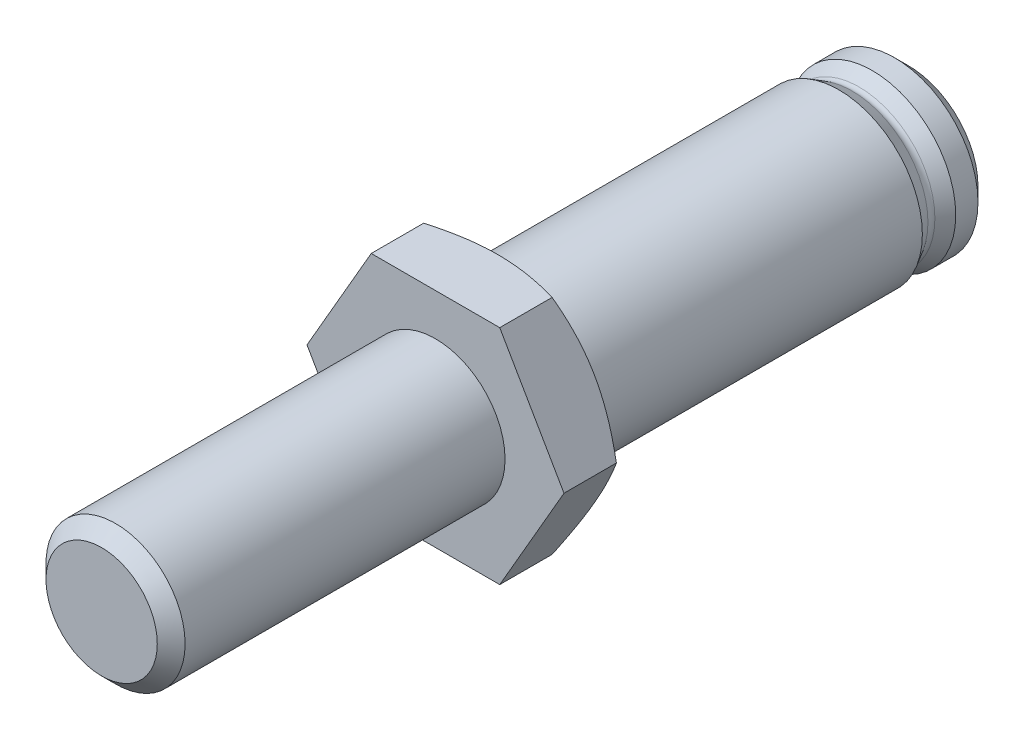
ISO-10303-21;
HEADER;
FILE_DESCRIPTION(('STEP AP214'),'2;1');
FILE_NAME('part.step','',(''),(''),'','','');
FILE_SCHEMA(('AUTOMOTIVE_DESIGN { 1 0 10303 214 1 1 1 1 }'));
ENDSEC;
DATA;
#1=APPLICATION_CONTEXT('core data for automotive mechanical design processes');
#2=APPLICATION_PROTOCOL_DEFINITION('international standard','automotive_design',2000,#1);
#3=PRODUCT_CONTEXT('',#1,'mechanical');
#4=PRODUCT('Part','Part','',(#3));
#5=PRODUCT_RELATED_PRODUCT_CATEGORY('part','',(#4));
#6=PRODUCT_DEFINITION_FORMATION('','',#4);
#7=PRODUCT_DEFINITION_CONTEXT('part definition',#1,'design');
#8=PRODUCT_DEFINITION('design','',#6,#7);
#9=PRODUCT_DEFINITION_SHAPE('','',#8);
#10=(LENGTH_UNIT() NAMED_UNIT(*) SI_UNIT(.MILLI.,.METRE.));
#11=(NAMED_UNIT(*) PLANE_ANGLE_UNIT() SI_UNIT($,.RADIAN.));
#12=(NAMED_UNIT(*) SI_UNIT($,.STERADIAN.) SOLID_ANGLE_UNIT());
#13=UNCERTAINTY_MEASURE_WITH_UNIT(LENGTH_MEASURE(1.E-05),#10,'distance_accuracy_value','');
#14=(GEOMETRIC_REPRESENTATION_CONTEXT(3) GLOBAL_UNCERTAINTY_ASSIGNED_CONTEXT((#13)) GLOBAL_UNIT_ASSIGNED_CONTEXT((#10,
#11,#12)) REPRESENTATION_CONTEXT('',''));
#15=CARTESIAN_POINT('',(0.,0.,0.));
#16=DIRECTION('',(0.,0.,1.));
#17=DIRECTION('',(1.,0.,0.));
#18=AXIS2_PLACEMENT_3D('',#15,#16,#17);
#19=CARTESIAN_POINT('',(6.9282032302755,4.,0.));
#20=DIRECTION('',(0.,0.,1.));
#21=DIRECTION('',(1.,0.,0.));
#22=AXIS2_PLACEMENT_3D('',#19,#20,#21);
#23=PLANE('',#22);
#24=DIRECTION('',(0.499999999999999,0.866025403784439,0.));
#25=VECTOR('',#24,1.);
#26=CARTESIAN_POINT('',(2.3094010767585,-4.00000000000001,0.));
#27=LINE('',#26,#25);
#28=CARTESIAN_POINT('',(2.3094010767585,-4.00000000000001,0.));
#29=VERTEX_POINT('',#28);
#30=CARTESIAN_POINT('',(4.61880215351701,0.,0.));
#31=VERTEX_POINT('',#30);
#32=EDGE_CURVE('E92',#29,#31,#27,.T.);
#33=ORIENTED_EDGE('',*,*,#32,.T.);
#34=DIRECTION('',(-0.5,0.866025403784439,0.));
#35=VECTOR('',#34,1.);
#36=CARTESIAN_POINT('',(4.61880215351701,0.,0.));
#37=LINE('',#36,#35);
#38=CARTESIAN_POINT('',(2.30940107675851,4.,0.));
#39=VERTEX_POINT('',#38);
#40=EDGE_CURVE('E97',#31,#39,#37,.T.);
#41=ORIENTED_EDGE('',*,*,#40,.T.);
#42=DIRECTION('',(-1.,0.,0.));
#43=VECTOR('',#42,1.);
#44=CARTESIAN_POINT('',(2.30940107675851,4.,0.));
#45=LINE('',#44,#43);
#46=CARTESIAN_POINT('',(-2.3094010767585,4.,0.));
#47=VERTEX_POINT('',#46);
#48=EDGE_CURVE('E244',#39,#47,#45,.T.);
#49=ORIENTED_EDGE('',*,*,#48,.T.);
#50=DIRECTION('',(-0.499999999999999,-0.866025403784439,0.));
#51=VECTOR('',#50,1.);
#52=CARTESIAN_POINT('',(-2.3094010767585,4.,0.));
#53=LINE('',#52,#51);
#54=CARTESIAN_POINT('',(-4.618802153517,0.,0.));
#55=VERTEX_POINT('',#54);
#56=EDGE_CURVE('E246',#47,#55,#53,.T.);
#57=ORIENTED_EDGE('',*,*,#56,.T.);
#58=DIRECTION('',(0.500000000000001,-0.866025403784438,0.));
#59=VECTOR('',#58,1.);
#60=CARTESIAN_POINT('',(-4.618802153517,0.,0.));
#61=LINE('',#60,#59);
#62=CARTESIAN_POINT('',(-2.30940107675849,-4.00000000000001,0.));
#63=VERTEX_POINT('',#62);
#64=EDGE_CURVE('E105',#55,#63,#61,.T.);
#65=ORIENTED_EDGE('',*,*,#64,.T.);
#66=DIRECTION('',(1.,0.,0.));
#67=VECTOR('',#66,1.);
#68=CARTESIAN_POINT('',(-2.30940107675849,-4.00000000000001,0.));
#69=LINE('',#68,#67);
#70=EDGE_CURVE('E100',#63,#29,#69,.T.);
#71=ORIENTED_EDGE('',*,*,#70,.T.);
#72=EDGE_LOOP('',(#33,#41,#49,#57,#65,#71));
#73=FACE_BOUND('',#72,.T.);
#74=CARTESIAN_POINT('',(0.,0.,0.));
#75=DIRECTION('',(0.,0.,1.));
#76=DIRECTION('',(1.,0.,0.));
#77=AXIS2_PLACEMENT_3D('',#74,#75,#76);
#78=CIRCLE('',#77,2.5);
#79=CARTESIAN_POINT('',(2.5,0.,0.));
#80=VERTEX_POINT('',#79);
#81=EDGE_CURVE('E218',#80,#80,#78,.T.);
#82=ORIENTED_EDGE('',*,*,#81,.F.);
#83=EDGE_LOOP('',(#82));
#84=FACE_BOUND('',#83,.T.);
#85=ADVANCED_FACE('F26',(#73,#84),#23,.T.);
#86=CARTESIAN_POINT('',(2.3094010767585,-4.00000000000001,-17.));
#87=DIRECTION('',(0.866025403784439,-0.499999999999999,0.));
#88=DIRECTION('',(0.499999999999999,0.866025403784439,0.));
#89=AXIS2_PLACEMENT_3D('',#86,#87,#88);
#90=PLANE('',#89);
#91=DIRECTION('',(0.,0.,1.));
#92=VECTOR('',#91,1.);
#93=CARTESIAN_POINT('',(2.3094010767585,-4.00000000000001,-17.));
#94=LINE('',#93,#92);
#95=CARTESIAN_POINT('',(2.3094010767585,-4.00000000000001,-1.88291128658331));
#96=VERTEX_POINT('',#95);
#97=EDGE_CURVE('E50',#96,#29,#94,.T.);
#98=ORIENTED_EDGE('',*,*,#97,.F.);
#99=CARTESIAN_POINT('',(2.30928560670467,-4.00020000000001,-1.8828446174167));
#100=CARTESIAN_POINT('',(2.4107717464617,-3.82442084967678,-1.94145900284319));
#101=CARTESIAN_POINT('',(2.51313390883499,-3.64712438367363,-1.99476655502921));
#102=CARTESIAN_POINT('',(2.71963072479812,-3.2894614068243,-2.08781520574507));
#103=CARTESIAN_POINT('',(2.82376904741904,-3.10908854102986,-2.12752338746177));
#104=CARTESIAN_POINT('',(3.03075510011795,-2.75057818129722,-2.18933466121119));
#105=CARTESIAN_POINT('',(3.13357098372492,-2.57249584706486,-2.21184914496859));
#106=CARTESIAN_POINT('',(3.33968651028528,-2.2154932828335,-2.23872625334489));
#107=CARTESIAN_POINT('',(3.44298540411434,-2.0365743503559,-2.24311113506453));
#108=CARTESIAN_POINT('',(3.63600352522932,-1.70225715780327,-2.23398680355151));
#109=CARTESIAN_POINT('',(3.72575165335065,-1.54680884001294,-2.22271792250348));
#110=CARTESIAN_POINT('',(3.90466320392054,-1.23692494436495,-2.18700288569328));
#111=CARTESIAN_POINT('',(3.99382600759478,-1.08249043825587,-2.16254453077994));
#112=CARTESIAN_POINT('',(4.17310641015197,-0.771967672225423,-2.10140081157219));
#113=CARTESIAN_POINT('',(4.26320131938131,-0.615918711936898,-2.06445627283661));
#114=CARTESIAN_POINT('',(4.4420474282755,-0.306148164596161,-1.98060680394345));
#115=CARTESIAN_POINT('',(4.53080091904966,-0.152422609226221,-1.93372157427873));
#116=CARTESIAN_POINT('',(4.61891762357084,0.000199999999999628,-1.88284461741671));
#117=B_SPLINE_CURVE_WITH_KNOTS('',3,(#99,#100,#101,#102,#103,#104,#105,#106,#107,#108,#109,#110,
#111,#112,#113,#114,#115,#116),.UNSPECIFIED.,.F.,.F.,(4,2,2,2,2,2,2,2,4),(0.,0.634047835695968,
1.26961969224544,1.88946157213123,2.50854226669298,3.04757825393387,3.58711366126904,
4.13861653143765,4.68903648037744),.UNSPECIFIED.);
#118=CARTESIAN_POINT('',(4.61880215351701,0.,-1.88291128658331));
#119=VERTEX_POINT('',#118);
#120=EDGE_CURVE('E83',#96,#119,#117,.T.);
#121=ORIENTED_EDGE('',*,*,#120,.T.);
#122=DIRECTION('',(0.,0.,1.));
#123=VECTOR('',#122,1.);
#124=CARTESIAN_POINT('',(4.61880215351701,0.,-17.));
#125=LINE('',#124,#123);
#126=EDGE_CURVE('E90',#119,#31,#125,.T.);
#127=ORIENTED_EDGE('',*,*,#126,.T.);
#128=ORIENTED_EDGE('',*,*,#32,.F.);
#129=EDGE_LOOP('',(#98,#121,#127,#128));
#130=FACE_BOUND('',#129,.T.);
#131=ADVANCED_FACE('F28',(#130),#90,.T.);
#132=CARTESIAN_POINT('',(-2.30940107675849,-4.00000000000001,-17.));
#133=DIRECTION('',(0.,-1.,0.));
#134=DIRECTION('',(0.,0.,-1.));
#135=AXIS2_PLACEMENT_3D('',#132,#133,#134);
#136=PLANE('',#135);
#137=DIRECTION('',(0.,0.,1.));
#138=VECTOR('',#137,1.);
#139=CARTESIAN_POINT('',(-2.30940107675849,-4.00000000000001,-17.));
#140=LINE('',#139,#138);
#141=CARTESIAN_POINT('',(-2.30940107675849,-4.00000000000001,-1.88291128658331));
#142=VERTEX_POINT('',#141);
#143=EDGE_CURVE('E235',#142,#63,#140,.T.);
#144=ORIENTED_EDGE('',*,*,#143,.F.);
#145=CARTESIAN_POINT('',(-6.10542974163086,-4.00000000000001,-0.335463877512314));
#146=CARTESIAN_POINT('',(-5.93151044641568,-4.00000000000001,-0.419431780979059));
#147=CARTESIAN_POINT('',(-5.7571811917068,-4.00000000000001,-0.502565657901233));
#148=CARTESIAN_POINT('',(-5.40748433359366,-4.00000000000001,-0.666694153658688));
#149=CARTESIAN_POINT('',(-5.23211656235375,-4.00000000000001,-0.747688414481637));
#150=CARTESIAN_POINT('',(-4.87917281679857,-4.00000000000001,-0.907495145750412));
#151=CARTESIAN_POINT('',(-4.70158994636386,-4.00000000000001,-0.986292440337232));
#152=CARTESIAN_POINT('',(-4.34497688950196,-4.00000000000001,-1.14052833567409));
#153=CARTESIAN_POINT('',(-4.16594677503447,-4.00000000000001,-1.21596710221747));
#154=CARTESIAN_POINT('',(-3.8007872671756,-4.00000000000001,-1.36478316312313));
#155=CARTESIAN_POINT('',(-3.61460526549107,-4.00000000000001,-1.43803209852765));
#156=CARTESIAN_POINT('',(-3.24002721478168,-4.00000000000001,-1.57874525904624));
#157=CARTESIAN_POINT('',(-3.05163091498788,-4.00000000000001,-1.6462088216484));
#158=CARTESIAN_POINT('',(-2.67271004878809,-4.00000000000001,-1.77350816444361));
#159=CARTESIAN_POINT('',(-2.48219102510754,-4.00000000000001,-1.83336027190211));
#160=CARTESIAN_POINT('',(-2.09842290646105,-4.00000000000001,-1.94345204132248));
#161=CARTESIAN_POINT('',(-1.90517472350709,-4.00000000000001,-1.99369483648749));
#162=CARTESIAN_POINT('',(-1.5168810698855,-4.00000000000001,-2.08183473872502));
#163=CARTESIAN_POINT('',(-1.32185005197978,-4.00000000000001,-2.11979431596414));
#164=CARTESIAN_POINT('',(-0.929469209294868,-4.00000000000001,-2.18115225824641));
#165=CARTESIAN_POINT('',(-0.732119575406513,-4.00000000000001,-2.20455181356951));
#166=CARTESIAN_POINT('',(-0.33862225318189,-4.00000000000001,-2.23461550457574));
#167=CARTESIAN_POINT('',(-0.142490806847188,-4.00000000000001,-2.24148702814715));
#168=CARTESIAN_POINT('',(0.249655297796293,-4.00000000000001,-2.23845234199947));
#169=CARTESIAN_POINT('',(0.445669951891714,-4.00000000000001,-2.22854555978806));
#170=CARTESIAN_POINT('',(0.781417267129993,-4.00000000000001,-2.19789206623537));
#171=CARTESIAN_POINT('',(0.921517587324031,-4.00000000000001,-2.18096449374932));
#172=CARTESIAN_POINT('',(1.2006212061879,-4.00000000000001,-2.13964654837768));
#173=CARTESIAN_POINT('',(1.33962434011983,-4.00000000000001,-2.11525507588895));
#174=CARTESIAN_POINT('',(1.75484240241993,-4.00000000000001,-2.03217461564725));
#175=CARTESIAN_POINT('',(2.02909693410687,-4.00000000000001,-1.96359699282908));
#176=CARTESIAN_POINT('',(2.43908664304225,-4.00000000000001,-1.84558669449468));
#177=CARTESIAN_POINT('',(2.57696821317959,-4.00000000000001,-1.8031940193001));
#178=CARTESIAN_POINT('',(2.85139071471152,-4.00000000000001,-1.71423334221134));
#179=CARTESIAN_POINT('',(2.98793163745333,-4.00000000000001,-1.66766531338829));
#180=CARTESIAN_POINT('',(3.25972084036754,-4.00000000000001,-1.57108214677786));
#181=CARTESIAN_POINT('',(3.39496957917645,-4.00000000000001,-1.52106828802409));
#182=CARTESIAN_POINT('',(3.6643617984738,-4.00000000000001,-1.41815906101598));
#183=CARTESIAN_POINT('',(3.7985052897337,-4.00000000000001,-1.36526372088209));
#184=CARTESIAN_POINT('',(4.10570582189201,-4.00000000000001,-1.24092840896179));
#185=CARTESIAN_POINT('',(4.27842892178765,-4.00000000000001,-1.16866505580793));
#186=CARTESIAN_POINT('',(4.62249700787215,-4.00000000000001,-1.02092061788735));
#187=CARTESIAN_POINT('',(4.79384192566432,-4.00000000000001,-0.945439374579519));
#188=CARTESIAN_POINT('',(5.13539733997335,-4.00000000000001,-0.791882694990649));
#189=CARTESIAN_POINT('',(5.30560764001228,-4.00000000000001,-0.713806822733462));
#190=CARTESIAN_POINT('',(5.64505145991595,-4.00000000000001,-0.555556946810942));
#191=CARTESIAN_POINT('',(5.81428496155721,-4.00000000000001,-0.475382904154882));
#192=CARTESIAN_POINT('',(6.32105005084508,-4.00000000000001,-0.232163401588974));
#193=CARTESIAN_POINT('',(6.65735099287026,-4.00000000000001,-0.0665549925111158));
#194=CARTESIAN_POINT('',(7.32760205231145,-4.00000000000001,0.269350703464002));
#195=CARTESIAN_POINT('',(7.66155209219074,-4.00000000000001,0.439648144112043));
#196=CARTESIAN_POINT('',(8.30140615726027,-4.00000000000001,0.770025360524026));
#197=CARTESIAN_POINT('',(8.6074422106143,-4.00000000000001,0.929849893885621));
#198=CARTESIAN_POINT('',(9.21838650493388,-4.00000000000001,1.25165862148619));
#199=CARTESIAN_POINT('',(9.52329471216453,-4.00000000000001,1.4136428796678));
#200=CARTESIAN_POINT('',(10.1315547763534,-4.00000000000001,1.73891005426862));
#201=CARTESIAN_POINT('',(10.4349085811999,-4.00000000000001,1.90218933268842));
#202=CARTESIAN_POINT('',(11.0408897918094,-4.00000000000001,2.23005574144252));
#203=CARTESIAN_POINT('',(11.3435172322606,-4.00000000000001,2.39464280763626));
#204=CARTESIAN_POINT('',(11.6458746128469,-4.00000000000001,2.55972101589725));
#205=B_SPLINE_CURVE_WITH_KNOTS('',3,(#145,#146,#147,#148,#149,#150,#151,#152,#153,#154,#155,
#156,#157,#158,#159,#160,#161,#162,#163,#164,#165,#166,#167,#168,#169,#170,#171,#172,#173,#174,
#175,#176,#177,#178,#179,#180,#181,#182,#183,#184,#185,#186,#187,#188,#189,#190,#191,#192,#193,
#194,#195,#196,#197,#198,#199,#200,#201,#202,#203,#204),.UNSPECIFIED.,.F.,.F.,(4,2,2,2,2,2,2,2,
2,2,2,2,2,2,2,2,2,2,2,2,2,2,2,2,2,2,2,2,2,4),(0.,0.579392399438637,1.15888113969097,
1.74169313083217,2.32447631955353,2.92462062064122,3.52483355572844,4.12373644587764,
4.72244372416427,5.31805639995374,5.91362037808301,6.50167152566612,7.08974273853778,
7.51289330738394,7.93610624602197,8.78303968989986,9.21576030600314,9.64848371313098,
10.0810473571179,10.5136067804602,11.0752552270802,11.6369313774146,12.1987023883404,
12.7604838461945,13.8850197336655,15.0095925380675,16.0453502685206,17.0811387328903,
18.1146500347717,19.1481109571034),.UNSPECIFIED.);
#206=EDGE_CURVE('E93',#142,#96,#205,.T.);
#207=ORIENTED_EDGE('',*,*,#206,.T.);
#208=ORIENTED_EDGE('',*,*,#97,.T.);
#209=ORIENTED_EDGE('',*,*,#70,.F.);
#210=EDGE_LOOP('',(#144,#207,#208,#209));
#211=FACE_BOUND('',#210,.T.);
#212=ADVANCED_FACE('F156',(#211),#136,.T.);
#213=CARTESIAN_POINT('',(-4.618802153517,0.,-17.));
#214=DIRECTION('',(-0.866025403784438,-0.500000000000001,0.));
#215=DIRECTION('',(0.500000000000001,-0.866025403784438,0.));
#216=AXIS2_PLACEMENT_3D('',#213,#214,#215);
#217=PLANE('',#216);
#218=DIRECTION('',(0.,0.,1.));
#219=VECTOR('',#218,1.);
#220=CARTESIAN_POINT('',(-4.618802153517,0.,-17.));
#221=LINE('',#220,#219);
#222=CARTESIAN_POINT('',(-4.618802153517,0.,-1.88291128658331));
#223=VERTEX_POINT('',#222);
#224=EDGE_CURVE('E237',#223,#55,#221,.T.);
#225=ORIENTED_EDGE('',*,*,#224,.F.);
#226=CARTESIAN_POINT('',(-4.61891762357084,0.000199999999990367,-1.88284461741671));
#227=CARTESIAN_POINT('',(-4.5174314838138,-0.175579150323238,-1.94145900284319));
#228=CARTESIAN_POINT('',(-4.41506932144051,-0.35287561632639,-1.99476655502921));
#229=CARTESIAN_POINT('',(-4.20857250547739,-0.710538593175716,-2.08781520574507));
#230=CARTESIAN_POINT('',(-4.10443418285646,-0.89091145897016,-2.12752338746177));
#231=CARTESIAN_POINT('',(-3.89744813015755,-1.2494218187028,-2.1893346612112));
#232=CARTESIAN_POINT('',(-3.79463224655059,-1.42750415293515,-2.21184914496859));
#233=CARTESIAN_POINT('',(-3.58851671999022,-1.78450671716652,-2.2387262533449));
#234=CARTESIAN_POINT('',(-3.48521782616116,-1.96342564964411,-2.24311113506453));
#235=CARTESIAN_POINT('',(-3.29219970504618,-2.29774284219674,-2.23398680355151));
#236=CARTESIAN_POINT('',(-3.20245157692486,-2.45319115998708,-2.22271792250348));
#237=CARTESIAN_POINT('',(-3.02354002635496,-2.76307505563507,-2.18700288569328));
#238=CARTESIAN_POINT('',(-2.93437722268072,-2.91750956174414,-2.16254453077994));
#239=CARTESIAN_POINT('',(-2.75509682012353,-3.22803232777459,-2.10140081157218));
#240=CARTESIAN_POINT('',(-2.66500191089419,-3.38408128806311,-2.06445627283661));
#241=CARTESIAN_POINT('',(-2.486155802,-3.69385183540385,-1.98060680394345));
#242=CARTESIAN_POINT('',(-2.39740231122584,-3.84757739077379,-1.93372157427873));
#243=CARTESIAN_POINT('',(-2.30928560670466,-4.00020000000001,-1.88284461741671));
#244=B_SPLINE_CURVE_WITH_KNOTS('',3,(#226,#227,#228,#229,#230,#231,#232,#233,#234,#235,#236,
#237,#238,#239,#240,#241,#242,#243),.UNSPECIFIED.,.F.,.F.,(4,2,2,2,2,2,2,2,4),(0.,
0.634047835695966,1.26961969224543,1.88946157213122,2.50854226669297,3.04757825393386,
3.58711366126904,4.13861653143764,4.68903648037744),.UNSPECIFIED.);
#245=EDGE_CURVE('E142',#223,#142,#244,.T.);
#246=ORIENTED_EDGE('',*,*,#245,.T.);
#247=ORIENTED_EDGE('',*,*,#143,.T.);
#248=ORIENTED_EDGE('',*,*,#64,.F.);
#249=EDGE_LOOP('',(#225,#246,#247,#248));
#250=FACE_BOUND('',#249,.T.);
#251=ADVANCED_FACE('F160',(#250),#217,.T.);
#252=CARTESIAN_POINT('',(-2.3094010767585,4.,-17.));
#253=DIRECTION('',(-0.866025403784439,0.499999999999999,0.));
#254=DIRECTION('',(-0.499999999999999,-0.866025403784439,0.));
#255=AXIS2_PLACEMENT_3D('',#252,#253,#254);
#256=PLANE('',#255);
#257=DIRECTION('',(0.,0.,1.));
#258=VECTOR('',#257,1.);
#259=CARTESIAN_POINT('',(-2.3094010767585,4.,-17.));
#260=LINE('',#259,#258);
#261=CARTESIAN_POINT('',(-2.3094010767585,4.,-1.88291128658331));
#262=VERTEX_POINT('',#261);
#263=EDGE_CURVE('E102',#262,#47,#260,.T.);
#264=ORIENTED_EDGE('',*,*,#263,.F.);
#265=CARTESIAN_POINT('',(-2.30928560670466,4.0002,-1.88284461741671));
#266=CARTESIAN_POINT('',(-2.4107717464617,3.82442084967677,-1.9414590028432));
#267=CARTESIAN_POINT('',(-2.51313390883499,3.64712438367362,-1.99476655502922));
#268=CARTESIAN_POINT('',(-2.71963072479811,3.28946140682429,-2.08781520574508));
#269=CARTESIAN_POINT('',(-2.82376904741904,3.10908854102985,-2.12752338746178));
#270=CARTESIAN_POINT('',(-3.03075510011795,2.75057818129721,-2.1893346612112));
#271=CARTESIAN_POINT('',(-3.13357098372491,2.57249584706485,-2.21184914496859));
#272=CARTESIAN_POINT('',(-3.33968651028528,2.21549328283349,-2.2387262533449));
#273=CARTESIAN_POINT('',(-3.44298540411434,2.03657435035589,-2.24311113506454));
#274=CARTESIAN_POINT('',(-3.63600352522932,1.70225715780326,-2.23398680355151));
#275=CARTESIAN_POINT('',(-3.72575165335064,1.54680884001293,-2.22271792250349));
#276=CARTESIAN_POINT('',(-3.90466320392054,1.23692494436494,-2.18700288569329));
#277=CARTESIAN_POINT('',(-3.99382600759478,1.08249043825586,-2.16254453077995));
#278=CARTESIAN_POINT('',(-4.17310641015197,0.771967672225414,-2.10140081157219));
#279=CARTESIAN_POINT('',(-4.26320131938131,0.61591871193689,-2.06445627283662));
#280=CARTESIAN_POINT('',(-4.4420474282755,0.306148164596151,-1.98060680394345));
#281=CARTESIAN_POINT('',(-4.53080091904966,0.152422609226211,-1.93372157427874));
#282=CARTESIAN_POINT('',(-4.61891762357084,-0.000200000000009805,-1.88284461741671));
#283=B_SPLINE_CURVE_WITH_KNOTS('',3,(#265,#266,#267,#268,#269,#270,#271,#272,#273,#274,#275,
#276,#277,#278,#279,#280,#281,#282),.UNSPECIFIED.,.F.,.F.,(4,2,2,2,2,2,2,2,4),(0.,
0.634047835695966,1.26961969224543,1.88946157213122,2.50854226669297,3.04757825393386,
3.58711366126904,4.13861653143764,4.68903648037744),.UNSPECIFIED.);
#284=EDGE_CURVE('E136',#262,#223,#283,.T.);
#285=ORIENTED_EDGE('',*,*,#284,.T.);
#286=ORIENTED_EDGE('',*,*,#224,.T.);
#287=ORIENTED_EDGE('',*,*,#56,.F.);
#288=EDGE_LOOP('',(#264,#285,#286,#287));
#289=FACE_BOUND('',#288,.T.);
#290=ADVANCED_FACE('F164',(#289),#256,.T.);
#291=CARTESIAN_POINT('',(2.30940107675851,4.,-17.));
#292=DIRECTION('',(0.,1.,0.));
#293=DIRECTION('',(0.,0.,1.));
#294=AXIS2_PLACEMENT_3D('',#291,#292,#293);
#295=PLANE('',#294);
#296=DIRECTION('',(0.,0.,1.));
#297=VECTOR('',#296,1.);
#298=CARTESIAN_POINT('',(2.30940107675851,4.,-17.));
#299=LINE('',#298,#297);
#300=CARTESIAN_POINT('',(2.30940107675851,4.,-1.88291128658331));
#301=VERTEX_POINT('',#300);
#302=EDGE_CURVE('E99',#301,#39,#299,.T.);
#303=ORIENTED_EDGE('',*,*,#302,.F.);
#304=CARTESIAN_POINT('',(-6.10542974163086,4.,-0.33546387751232));
#305=CARTESIAN_POINT('',(-5.93151044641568,4.,-0.419431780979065));
#306=CARTESIAN_POINT('',(-5.75718119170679,4.,-0.502565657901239));
#307=CARTESIAN_POINT('',(-5.40748433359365,4.,-0.666694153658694));
#308=CARTESIAN_POINT('',(-5.23211656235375,4.,-0.747688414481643));
#309=CARTESIAN_POINT('',(-4.87917281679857,4.,-0.907495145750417));
#310=CARTESIAN_POINT('',(-4.70158994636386,4.,-0.986292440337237));
#311=CARTESIAN_POINT('',(-4.34497688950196,4.,-1.14052833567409));
#312=CARTESIAN_POINT('',(-4.16594677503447,4.,-1.21596710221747));
#313=CARTESIAN_POINT('',(-3.8007872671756,4.,-1.36478316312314));
#314=CARTESIAN_POINT('',(-3.61460526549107,4.,-1.43803209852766));
#315=CARTESIAN_POINT('',(-3.24002721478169,4.,-1.57874525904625));
#316=CARTESIAN_POINT('',(-3.05163091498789,4.,-1.64620882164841));
#317=CARTESIAN_POINT('',(-2.67271004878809,4.,-1.77350816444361));
#318=CARTESIAN_POINT('',(-2.48219102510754,4.,-1.83336027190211));
#319=CARTESIAN_POINT('',(-2.09842290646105,4.,-1.94345204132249));
#320=CARTESIAN_POINT('',(-1.9051747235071,4.,-1.99369483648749));
#321=CARTESIAN_POINT('',(-1.51688106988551,4.,-2.08183473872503));
#322=CARTESIAN_POINT('',(-1.32185005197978,4.,-2.11979431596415));
#323=CARTESIAN_POINT('',(-0.929469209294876,4.,-2.18115225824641));
#324=CARTESIAN_POINT('',(-0.732119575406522,4.,-2.20455181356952));
#325=CARTESIAN_POINT('',(-0.3386222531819,4.,-2.23461550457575));
#326=CARTESIAN_POINT('',(-0.142490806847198,4.,-2.24148702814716));
#327=CARTESIAN_POINT('',(0.249655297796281,4.,-2.23845234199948));
#328=CARTESIAN_POINT('',(0.445669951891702,4.,-2.22854555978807));
#329=CARTESIAN_POINT('',(0.781417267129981,4.,-2.19789206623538));
#330=CARTESIAN_POINT('',(0.921517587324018,4.,-2.18096449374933));
#331=CARTESIAN_POINT('',(1.20062120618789,4.,-2.13964654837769));
#332=CARTESIAN_POINT('',(1.33962434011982,4.,-2.11525507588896));
#333=CARTESIAN_POINT('',(1.75484240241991,4.,-2.03217461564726));
#334=CARTESIAN_POINT('',(2.02909693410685,4.,-1.96359699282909));
#335=CARTESIAN_POINT('',(2.43908664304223,4.,-1.84558669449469));
#336=CARTESIAN_POINT('',(2.57696821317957,4.,-1.80319401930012));
#337=CARTESIAN_POINT('',(2.8513907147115,4.,-1.71423334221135));
#338=CARTESIAN_POINT('',(2.9879316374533,4.,-1.6676653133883));
#339=CARTESIAN_POINT('',(3.25972084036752,4.,-1.57108214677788));
#340=CARTESIAN_POINT('',(3.39496957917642,4.,-1.52106828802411));
#341=CARTESIAN_POINT('',(3.66436179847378,4.,-1.41815906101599));
#342=CARTESIAN_POINT('',(3.79850528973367,4.,-1.36526372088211));
#343=CARTESIAN_POINT('',(4.10570582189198,4.,-1.2409284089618));
#344=CARTESIAN_POINT('',(4.27842892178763,4.,-1.16866505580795));
#345=CARTESIAN_POINT('',(4.62249700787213,4.,-1.02092061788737));
#346=CARTESIAN_POINT('',(4.79384192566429,4.,-0.945439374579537));
#347=CARTESIAN_POINT('',(5.13539733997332,4.,-0.791882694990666));
#348=CARTESIAN_POINT('',(5.30560764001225,4.,-0.71380682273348));
#349=CARTESIAN_POINT('',(5.64505145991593,4.,-0.55555694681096));
#350=CARTESIAN_POINT('',(5.81428496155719,4.,-0.475382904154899));
#351=CARTESIAN_POINT('',(6.32105005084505,4.,-0.232163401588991));
#352=CARTESIAN_POINT('',(6.65735099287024,4.,-0.0665549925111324));
#353=CARTESIAN_POINT('',(7.32760205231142,4.,0.269350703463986));
#354=CARTESIAN_POINT('',(7.66155209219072,4.,0.439648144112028));
#355=CARTESIAN_POINT('',(8.30140615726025,4.,0.770025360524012));
#356=CARTESIAN_POINT('',(8.60744221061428,4.,0.929849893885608));
#357=CARTESIAN_POINT('',(9.21838650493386,4.,1.25165862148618));
#358=CARTESIAN_POINT('',(9.52329471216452,4.,1.41364287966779));
#359=CARTESIAN_POINT('',(10.1315547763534,4.,1.73891005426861));
#360=CARTESIAN_POINT('',(10.4349085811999,4.,1.90218933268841));
#361=CARTESIAN_POINT('',(11.0408897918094,4.,2.23005574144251));
#362=CARTESIAN_POINT('',(11.3435172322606,4.,2.39464280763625));
#363=CARTESIAN_POINT('',(11.6458746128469,4.,2.55972101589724));
#364=B_SPLINE_CURVE_WITH_KNOTS('',3,(#304,#305,#306,#307,#308,#309,#310,#311,#312,#313,#314,
#315,#316,#317,#318,#319,#320,#321,#322,#323,#324,#325,#326,#327,#328,#329,#330,#331,#332,#333,
#334,#335,#336,#337,#338,#339,#340,#341,#342,#343,#344,#345,#346,#347,#348,#349,#350,#351,#352,
#353,#354,#355,#356,#357,#358,#359,#360,#361,#362,#363),.UNSPECIFIED.,.F.,.F.,(4,2,2,2,2,2,2,2,
2,2,2,2,2,2,2,2,2,2,2,2,2,2,2,2,2,2,2,2,2,4),(0.,0.579392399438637,1.15888113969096,
1.74169313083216,2.32447631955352,2.92462062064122,3.52483355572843,4.12373644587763,
4.72244372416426,5.31805639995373,5.913620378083,6.50167152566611,7.08974273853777,
7.51289330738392,7.93610624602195,8.78303968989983,9.21576030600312,9.64848371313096,
10.0810473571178,10.5136067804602,11.0752552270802,11.6369313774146,12.1987023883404,
12.7604838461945,13.8850197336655,15.0095925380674,16.0453502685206,17.0811387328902,
18.1146500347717,19.1481109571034),.UNSPECIFIED.);
#365=EDGE_CURVE('E42',#301,#262,#364,.F.);
#366=ORIENTED_EDGE('',*,*,#365,.T.);
#367=ORIENTED_EDGE('',*,*,#263,.T.);
#368=ORIENTED_EDGE('',*,*,#48,.F.);
#369=EDGE_LOOP('',(#303,#366,#367,#368));
#370=FACE_BOUND('',#369,.T.);
#371=ADVANCED_FACE('F168',(#370),#295,.T.);
#372=CARTESIAN_POINT('',(4.61880215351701,0.,-17.));
#373=DIRECTION('',(0.866025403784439,0.5,0.));
#374=DIRECTION('',(-0.5,0.866025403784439,0.));
#375=AXIS2_PLACEMENT_3D('',#372,#373,#374);
#376=PLANE('',#375);
#377=ORIENTED_EDGE('',*,*,#126,.F.);
#378=CARTESIAN_POINT('',(4.61891762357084,-0.000199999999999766,-1.88284461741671));
#379=CARTESIAN_POINT('',(4.5174314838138,0.175579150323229,-1.94145900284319));
#380=CARTESIAN_POINT('',(4.41506932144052,0.352875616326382,-1.99476655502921));
#381=CARTESIAN_POINT('',(4.20857250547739,0.710538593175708,-2.08781520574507));
#382=CARTESIAN_POINT('',(4.10443418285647,0.890911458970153,-2.12752338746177));
#383=CARTESIAN_POINT('',(3.89744813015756,1.24942181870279,-2.1893346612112));
#384=CARTESIAN_POINT('',(3.79463224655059,1.42750415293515,-2.21184914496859));
#385=CARTESIAN_POINT('',(3.58851671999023,1.78450671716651,-2.2387262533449));
#386=CARTESIAN_POINT('',(3.48521782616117,1.9634256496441,-2.24311113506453));
#387=CARTESIAN_POINT('',(3.29219970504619,2.29774284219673,-2.23398680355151));
#388=CARTESIAN_POINT('',(3.20245157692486,2.45319115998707,-2.22271792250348));
#389=CARTESIAN_POINT('',(3.02354002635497,2.76307505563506,-2.18700288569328));
#390=CARTESIAN_POINT('',(2.93437722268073,2.91750956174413,-2.16254453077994));
#391=CARTESIAN_POINT('',(2.75509682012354,3.22803232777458,-2.10140081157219));
#392=CARTESIAN_POINT('',(2.6650019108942,3.3840812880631,-2.06445627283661));
#393=CARTESIAN_POINT('',(2.48615580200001,3.69385183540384,-1.98060680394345));
#394=CARTESIAN_POINT('',(2.39740231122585,3.84757739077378,-1.93372157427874));
#395=CARTESIAN_POINT('',(2.30928560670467,4.0002,-1.88284461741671));
#396=B_SPLINE_CURVE_WITH_KNOTS('',3,(#378,#379,#380,#381,#382,#383,#384,#385,#386,#387,#388,
#389,#390,#391,#392,#393,#394,#395),.UNSPECIFIED.,.F.,.F.,(4,2,2,2,2,2,2,2,4),(0.,
0.634047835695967,1.26961969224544,1.88946157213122,2.50854226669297,3.04757825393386,
3.58711366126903,4.13861653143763,4.68903648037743),.UNSPECIFIED.);
#397=EDGE_CURVE('E79',#119,#301,#396,.T.);
#398=ORIENTED_EDGE('',*,*,#397,.T.);
#399=ORIENTED_EDGE('',*,*,#302,.T.);
#400=ORIENTED_EDGE('',*,*,#40,.F.);
#401=EDGE_LOOP('',(#377,#398,#399,#400));
#402=FACE_BOUND('',#401,.T.);
#403=ADVANCED_FACE('F95',(#402),#376,.T.);
#404=CARTESIAN_POINT('',(0.,0.,0.460032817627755));
#405=DIRECTION('',(0.,0.,1.));
#406=DIRECTION('',(1.,0.,0.));
#407=AXIS2_PLACEMENT_3D('',#404,#405,#406);
#408=CYLINDRICAL_SURFACE('',#407,3.);
#409=CARTESIAN_POINT('',(0.,0.,-16.5));
#410=DIRECTION('',(0.,0.,1.));
#411=DIRECTION('',(1.,0.,0.));
#412=AXIS2_PLACEMENT_3D('',#409,#410,#411);
#413=CIRCLE('',#412,3.);
#414=CARTESIAN_POINT('',(3.,0.,-16.5));
#415=VERTEX_POINT('',#414);
#416=EDGE_CURVE('E35',#415,#415,#413,.T.);
#417=ORIENTED_EDGE('',*,*,#416,.T.);
#418=EDGE_LOOP('',(#417));
#419=FACE_BOUND('',#418,.T.);
#420=CARTESIAN_POINT('',(0.,0.,-15.7));
#421=DIRECTION('',(0.,0.,1.));
#422=DIRECTION('',(1.,0.,0.));
#423=AXIS2_PLACEMENT_3D('',#420,#421,#422);
#424=CIRCLE('',#423,3.);
#425=CARTESIAN_POINT('',(3.,0.,-15.7));
#426=VERTEX_POINT('',#425);
#427=EDGE_CURVE('E226',#426,#426,#424,.T.);
#428=ORIENTED_EDGE('',*,*,#427,.F.);
#429=EDGE_LOOP('',(#428));
#430=FACE_BOUND('',#429,.T.);
#431=ADVANCED_FACE('F176',(#419,#430),#408,.T.);
#432=CARTESIAN_POINT('',(0.,0.,-15.225));
#433=DIRECTION('',(0.,0.,-1.));
#434=DIRECTION('',(-1.,0.,0.));
#435=AXIS2_PLACEMENT_3D('',#432,#433,#434);
#436=CONICAL_SURFACE('',#435,2.72575862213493,0.523598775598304);
#437=ORIENTED_EDGE('',*,*,#427,.T.);
#438=EDGE_LOOP('',(#437));
#439=FACE_BOUND('',#438,.T.);
#440=CARTESIAN_POINT('',(0.,0.,-15.225));
#441=DIRECTION('',(0.,0.,1.));
#442=DIRECTION('',(1.,0.,0.));
#443=AXIS2_PLACEMENT_3D('',#440,#441,#442);
#444=CIRCLE('',#443,2.72575862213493);
#445=CARTESIAN_POINT('',(2.72575862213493,0.,-15.225));
#446=VERTEX_POINT('',#445);
#447=EDGE_CURVE('E224',#446,#446,#444,.T.);
#448=ORIENTED_EDGE('',*,*,#447,.F.);
#449=EDGE_LOOP('',(#448));
#450=FACE_BOUND('',#449,.T.);
#451=ADVANCED_FACE('F187',(#439,#450),#436,.T.);
#452=CARTESIAN_POINT('',(0.,0.,-15.1));
#453=DIRECTION('',(0.,0.,1.));
#454=DIRECTION('',(1.,0.,0.));
#455=AXIS2_PLACEMENT_3D('',#452,#453,#454);
#456=TOROIDAL_SURFACE('',#455,2.94226497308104,0.250000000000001);
#457=ORIENTED_EDGE('',*,*,#447,.T.);
#458=EDGE_LOOP('',(#457));
#459=FACE_BOUND('',#458,.T.);
#460=CARTESIAN_POINT('',(0.,0.,-14.975));
#461=DIRECTION('',(0.,0.,1.));
#462=DIRECTION('',(1.,0.,0.));
#463=AXIS2_PLACEMENT_3D('',#460,#461,#462);
#464=CIRCLE('',#463,2.72575862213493);
#465=CARTESIAN_POINT('',(2.72575862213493,0.,-14.975));
#466=VERTEX_POINT('',#465);
#467=EDGE_CURVE('E215',#466,#466,#464,.T.);
#468=ORIENTED_EDGE('',*,*,#467,.F.);
#469=EDGE_LOOP('',(#468));
#470=FACE_BOUND('',#469,.T.);
#471=ADVANCED_FACE('F191',(#459,#470),#456,.F.);
#472=CARTESIAN_POINT('',(0.,0.,-14.5));
#473=DIRECTION('',(0.,0.,1.));
#474=DIRECTION('',(1.,0.,0.));
#475=AXIS2_PLACEMENT_3D('',#472,#473,#474);
#476=CONICAL_SURFACE('',#475,3.,0.523598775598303);
#477=ORIENTED_EDGE('',*,*,#467,.T.);
#478=EDGE_LOOP('',(#477));
#479=FACE_BOUND('',#478,.T.);
#480=CARTESIAN_POINT('',(0.,0.,-14.5));
#481=DIRECTION('',(0.,0.,1.));
#482=DIRECTION('',(1.,0.,0.));
#483=AXIS2_PLACEMENT_3D('',#480,#481,#482);
#484=CIRCLE('',#483,3.);
#485=CARTESIAN_POINT('',(3.,0.,-14.5));
#486=VERTEX_POINT('',#485);
#487=EDGE_CURVE('E209',#486,#486,#484,.T.);
#488=ORIENTED_EDGE('',*,*,#487,.F.);
#489=EDGE_LOOP('',(#488));
#490=FACE_BOUND('',#489,.T.);
#491=ADVANCED_FACE('F195',(#479,#490),#476,.T.);
#492=CARTESIAN_POINT('',(0.,0.,0.460032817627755));
#493=DIRECTION('',(0.,0.,1.));
#494=DIRECTION('',(1.,0.,0.));
#495=AXIS2_PLACEMENT_3D('',#492,#493,#494);
#496=CYLINDRICAL_SURFACE('',#495,3.);
#497=ORIENTED_EDGE('',*,*,#487,.T.);
#498=EDGE_LOOP('',(#497));
#499=FACE_BOUND('',#498,.T.);
#500=CARTESIAN_POINT('',(0.,0.,-2.5));
#501=DIRECTION('',(0.,0.,1.));
#502=DIRECTION('',(1.,0.,0.));
#503=AXIS2_PLACEMENT_3D('',#500,#501,#502);
#504=CIRCLE('',#503,3.);
#505=CARTESIAN_POINT('',(3.,0.,-2.5));
#506=VERTEX_POINT('',#505);
#507=EDGE_CURVE('E212',#506,#506,#504,.T.);
#508=ORIENTED_EDGE('',*,*,#507,.F.);
#509=EDGE_LOOP('',(#508));
#510=FACE_BOUND('',#509,.T.);
#511=ADVANCED_FACE('F198',(#499,#510),#496,.T.);
#512=CARTESIAN_POINT('',(0.,3.549973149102,-2.5));
#513=DIRECTION('',(0.,0.,-1.));
#514=DIRECTION('',(-1.,0.,0.));
#515=AXIS2_PLACEMENT_3D('',#512,#513,#514);
#516=PLANE('',#515);
#517=ORIENTED_EDGE('',*,*,#507,.T.);
#518=EDGE_LOOP('',(#517));
#519=FACE_BOUND('',#518,.T.);
#520=CARTESIAN_POINT('',(0.,0.,-2.5));
#521=DIRECTION('',(0.,0.,1.));
#522=DIRECTION('',(1.,0.,0.));
#523=AXIS2_PLACEMENT_3D('',#520,#521,#522);
#524=CIRCLE('',#523,3.549973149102);
#525=CARTESIAN_POINT('',(3.549973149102,0.,-2.5));
#526=VERTEX_POINT('',#525);
#527=EDGE_CURVE('E213',#526,#526,#524,.T.);
#528=ORIENTED_EDGE('',*,*,#527,.F.);
#529=EDGE_LOOP('',(#528));
#530=FACE_BOUND('',#529,.T.);
#531=ADVANCED_FACE('F121',(#519,#530),#516,.T.);
#532=CARTESIAN_POINT('',(0.,0.,-1.76341617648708));
#533=DIRECTION('',(0.,0.,1.));
#534=DIRECTION('',(1.,0.,0.));
#535=AXIS2_PLACEMENT_3D('',#532,#533,#534);
#536=CONICAL_SURFACE('',#535,4.82577375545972,1.0471975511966);
#537=ORIENTED_EDGE('',*,*,#206,.F.);
#538=ORIENTED_EDGE('',*,*,#245,.F.);
#539=ORIENTED_EDGE('',*,*,#284,.F.);
#540=ORIENTED_EDGE('',*,*,#365,.F.);
#541=ORIENTED_EDGE('',*,*,#397,.F.);
#542=ORIENTED_EDGE('',*,*,#120,.F.);
#543=EDGE_LOOP('',(#537,#538,#539,#540,#541,#542));
#544=FACE_BOUND('',#543,.T.);
#545=ORIENTED_EDGE('',*,*,#527,.T.);
#546=EDGE_LOOP('',(#545));
#547=FACE_BOUND('',#546,.T.);
#548=ADVANCED_FACE('F81',(#544,#547),#536,.T.);
#549=CARTESIAN_POINT('',(6.9282032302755,4.,-17.));
#550=DIRECTION('',(0.,0.,1.));
#551=DIRECTION('',(1.,0.,0.));
#552=AXIS2_PLACEMENT_3D('',#549,#550,#551);
#553=PLANE('',#552);
#554=CARTESIAN_POINT('',(0.,0.,-17.));
#555=DIRECTION('',(0.,0.,1.));
#556=DIRECTION('',(1.,0.,0.));
#557=AXIS2_PLACEMENT_3D('',#554,#555,#556);
#558=CIRCLE('',#557,2.5);
#559=CARTESIAN_POINT('',(2.5,0.,-17.));
#560=VERTEX_POINT('',#559);
#561=EDGE_CURVE('E11',#560,#560,#558,.F.);
#562=ORIENTED_EDGE('',*,*,#561,.T.);
#563=EDGE_LOOP('',(#562));
#564=FACE_BOUND('',#563,.T.);
#565=ADVANCED_FACE('F120',(#564),#553,.F.);
#566=CARTESIAN_POINT('',(0.,0.,12.));
#567=DIRECTION('',(0.,0.,-1.));
#568=DIRECTION('',(-1.,0.,0.));
#569=AXIS2_PLACEMENT_3D('',#566,#567,#568);
#570=CYLINDRICAL_SURFACE('',#569,2.5);
#571=CARTESIAN_POINT('',(0.,0.,11.5));
#572=DIRECTION('',(0.,0.,1.));
#573=DIRECTION('',(1.,0.,0.));
#574=AXIS2_PLACEMENT_3D('',#571,#572,#573);
#575=CIRCLE('',#574,2.5);
#576=CARTESIAN_POINT('',(2.5,0.,11.5));
#577=VERTEX_POINT('',#576);
#578=EDGE_CURVE('E271',#577,#577,#575,.F.);
#579=ORIENTED_EDGE('',*,*,#578,.T.);
#580=EDGE_LOOP('',(#579));
#581=FACE_BOUND('',#580,.T.);
#582=ORIENTED_EDGE('',*,*,#81,.T.);
#583=EDGE_LOOP('',(#582));
#584=FACE_BOUND('',#583,.T.);
#585=ADVANCED_FACE('F122',(#581,#584),#570,.T.);
#586=CARTESIAN_POINT('',(0.,0.,12.));
#587=DIRECTION('',(0.,0.,1.));
#588=DIRECTION('',(1.,0.,0.));
#589=AXIS2_PLACEMENT_3D('',#586,#587,#588);
#590=PLANE('',#589);
#591=CARTESIAN_POINT('',(0.,0.,12.));
#592=DIRECTION('',(0.,0.,1.));
#593=DIRECTION('',(1.,0.,0.));
#594=AXIS2_PLACEMENT_3D('',#591,#592,#593);
#595=CIRCLE('',#594,2.);
#596=CARTESIAN_POINT('',(2.,0.,12.));
#597=VERTEX_POINT('',#596);
#598=EDGE_CURVE('E87',#597,#597,#595,.T.);
#599=ORIENTED_EDGE('',*,*,#598,.T.);
#600=EDGE_LOOP('',(#599));
#601=FACE_BOUND('',#600,.T.);
#602=ADVANCED_FACE('F260',(#601),#590,.T.);
#603=CARTESIAN_POINT('',(0.,0.,12.));
#604=DIRECTION('',(0.,0.,-1.));
#605=DIRECTION('',(-1.,0.,0.));
#606=AXIS2_PLACEMENT_3D('',#603,#604,#605);
#607=CONICAL_SURFACE('',#606,2.,0.785398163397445);
#608=ORIENTED_EDGE('',*,*,#578,.F.);
#609=EDGE_LOOP('',(#608));
#610=FACE_BOUND('',#609,.T.);
#611=ORIENTED_EDGE('',*,*,#598,.F.);
#612=EDGE_LOOP('',(#611));
#613=FACE_BOUND('',#612,.T.);
#614=ADVANCED_FACE('F265',(#610,#613),#607,.T.);
#615=CARTESIAN_POINT('',(0.,0.,-16.5));
#616=DIRECTION('',(0.,0.,1.));
#617=DIRECTION('',(1.,0.,0.));
#618=AXIS2_PLACEMENT_3D('',#615,#616,#617);
#619=CONICAL_SURFACE('',#618,3.,0.785398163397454);
#620=ORIENTED_EDGE('',*,*,#561,.F.);
#621=EDGE_LOOP('',(#620));
#622=FACE_BOUND('',#621,.T.);
#623=ORIENTED_EDGE('',*,*,#416,.F.);
#624=EDGE_LOOP('',(#623));
#625=FACE_BOUND('',#624,.T.);
#626=ADVANCED_FACE('F278',(#622,#625),#619,.T.);
#627=CLOSED_SHELL('',(#85,#131,#212,#251,#290,#371,#403,#431,#451,#471,#491,#511,#531,#548,#565,
#585,#602,#614,#626));
#628=MANIFOLD_SOLID_BREP('B2',#627);
#629=ADVANCED_BREP_SHAPE_REPRESENTATION('',(#18,#628),#14);
#630=SHAPE_DEFINITION_REPRESENTATION(#9,#629);
ENDSEC;
END-ISO-10303-21;
